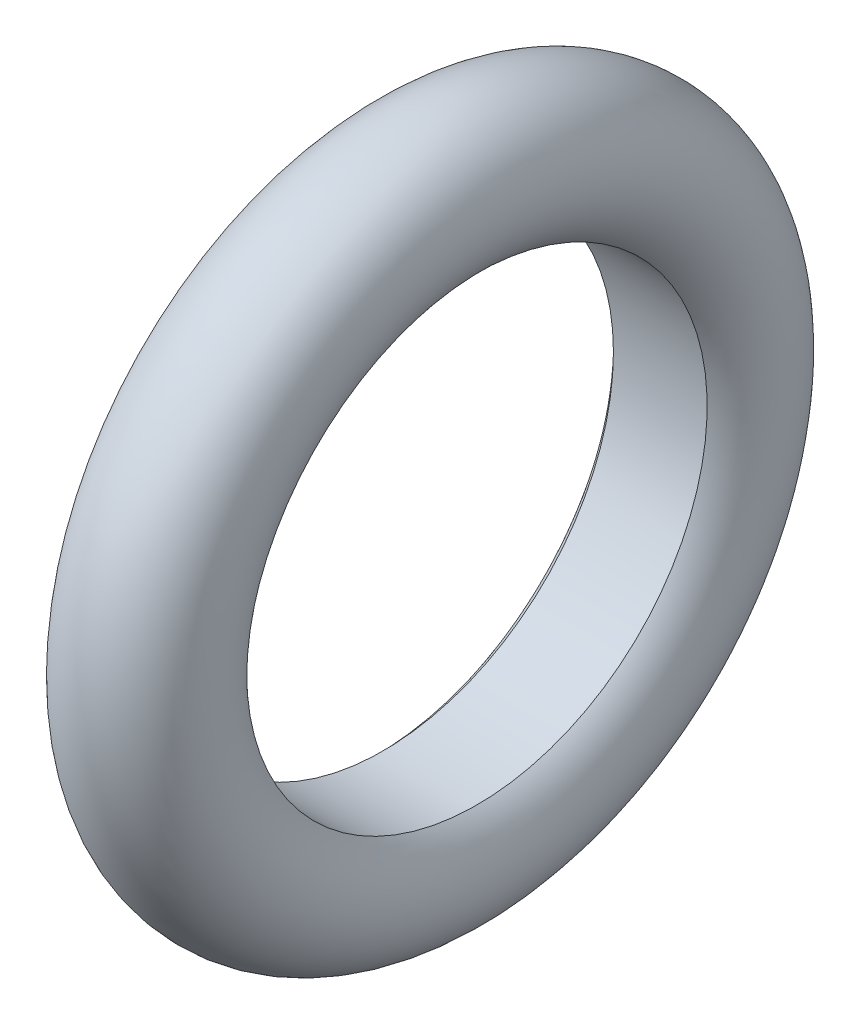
from build123d import *

# Parameters (mm, degrees)
ESQUISSE1_R                  = 1
ENL_V_MAT_EXTRU_2_DEPTH      = 8.141428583
ENL_V_MAT_EXTRU_2_DEPTH_BACK = 8.141428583
ESQUISSE2_R                  = 3.25


with BuildPart() as part:
    # Esquisse1 → R_volution1 (revolve)
    with BuildSketch(Plane.XY, mode=Mode.PRIVATE) as r_volution1_sk:
        with Locations((0, 4)):
            Circle(ESQUISSE1_R)
    revolve(r_volution1_sk.sketch.rotate(Axis((0, 0, 0), (1, 0, 0)), 90), axis=Axis((0, 0, 0), (1, 0, 0)))

    # Esquisse2 → Enl_v. mat.-Extru.2 (cut, two sides: drawn at the far end of the back side and taken through both)
    with BuildSketch(Plane(origin=(0, 0, 0), x_dir=(0, 0, -1), z_dir=(1, 0, 0)).offset(-ENL_V_MAT_EXTRU_2_DEPTH_BACK)):
        with Locations(Location((0, 0, 0), (0, 0, 180))):
            Circle(ESQUISSE2_R)
    extrude(amount=ENL_V_MAT_EXTRU_2_DEPTH + ENL_V_MAT_EXTRU_2_DEPTH_BACK, mode=Mode.SUBTRACT)


solid = part.part
